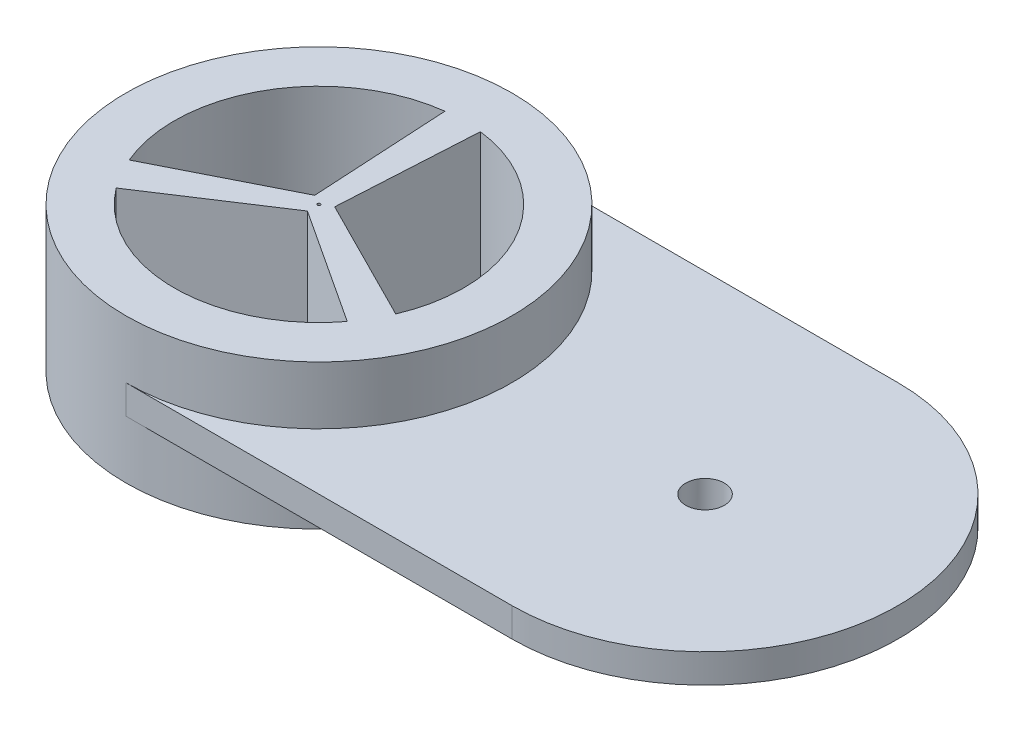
ISO-10303-21;
HEADER;
FILE_DESCRIPTION(('STEP AP214'),'2;1');
FILE_NAME('part.step','',(''),(''),'','','');
FILE_SCHEMA(('AUTOMOTIVE_DESIGN { 1 0 10303 214 1 1 1 1 }'));
ENDSEC;
DATA;
#1=APPLICATION_CONTEXT('core data for automotive mechanical design processes');
#2=APPLICATION_PROTOCOL_DEFINITION('international standard','automotive_design',2000,#1);
#3=PRODUCT_CONTEXT('',#1,'mechanical');
#4=PRODUCT('Part','Part','',(#3));
#5=PRODUCT_RELATED_PRODUCT_CATEGORY('part','',(#4));
#6=PRODUCT_DEFINITION_FORMATION('','',#4);
#7=PRODUCT_DEFINITION_CONTEXT('part definition',#1,'design');
#8=PRODUCT_DEFINITION('design','',#6,#7);
#9=PRODUCT_DEFINITION_SHAPE('','',#8);
#10=(LENGTH_UNIT() NAMED_UNIT(*) SI_UNIT(.MILLI.,.METRE.));
#11=(NAMED_UNIT(*) PLANE_ANGLE_UNIT() SI_UNIT($,.RADIAN.));
#12=(NAMED_UNIT(*) SI_UNIT($,.STERADIAN.) SOLID_ANGLE_UNIT());
#13=UNCERTAINTY_MEASURE_WITH_UNIT(LENGTH_MEASURE(1.E-05),#10,'distance_accuracy_value','');
#14=(GEOMETRIC_REPRESENTATION_CONTEXT(3) GLOBAL_UNCERTAINTY_ASSIGNED_CONTEXT((#13)) GLOBAL_UNIT_ASSIGNED_CONTEXT((#10,
#11,#12)) REPRESENTATION_CONTEXT('',''));
#15=CARTESIAN_POINT('',(0.,0.,0.));
#16=DIRECTION('',(0.,0.,1.));
#17=DIRECTION('',(1.,0.,0.));
#18=AXIS2_PLACEMENT_3D('',#15,#16,#17);
#19=CARTESIAN_POINT('',(0.,15.,0.));
#20=DIRECTION('',(0.,-1.,0.));
#21=DIRECTION('',(0.,0.,-1.));
#22=AXIS2_PLACEMENT_3D('',#19,#20,#21);
#23=CYLINDRICAL_SURFACE('',#22,20.);
#24=CARTESIAN_POINT('',(0.,0.,0.));
#25=DIRECTION('',(0.,1.,0.));
#26=DIRECTION('',(0.,0.,1.));
#27=AXIS2_PLACEMENT_3D('',#24,#25,#26);
#28=CIRCLE('',#27,20.);
#29=CARTESIAN_POINT('',(0.,0.,20.));
#30=VERTEX_POINT('',#29);
#31=EDGE_CURVE('E166',#30,#30,#28,.T.);
#32=ORIENTED_EDGE('',*,*,#31,.T.);
#33=EDGE_LOOP('',(#32));
#34=FACE_BOUND('',#33,.T.);
#35=CARTESIAN_POINT('',(0.,15.,0.));
#36=DIRECTION('',(0.,1.,0.));
#37=DIRECTION('',(0.,0.,1.));
#38=AXIS2_PLACEMENT_3D('',#35,#36,#37);
#39=CIRCLE('',#38,20.);
#40=CARTESIAN_POINT('',(0.,15.,20.));
#41=VERTEX_POINT('',#40);
#42=EDGE_CURVE('E156',#41,#41,#39,.T.);
#43=ORIENTED_EDGE('',*,*,#42,.F.);
#44=EDGE_LOOP('',(#43));
#45=FACE_BOUND('',#44,.T.);
#46=DIRECTION('',(0.,-1.,0.));
#47=VECTOR('',#46,1.);
#48=CARTESIAN_POINT('',(0.,15.,20.));
#49=LINE('',#48,#47);
#50=CARTESIAN_POINT('',(0.,9.00000000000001,20.));
#51=VERTEX_POINT('',#50);
#52=CARTESIAN_POINT('',(0.,6.00000000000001,20.));
#53=VERTEX_POINT('',#52);
#54=EDGE_CURVE('E321',#51,#53,#49,.T.);
#55=ORIENTED_EDGE('',*,*,#54,.F.);
#56=CARTESIAN_POINT('',(0.,9.,0.));
#57=DIRECTION('',(0.,-1.,0.));
#58=DIRECTION('',(0.,0.,-1.));
#59=AXIS2_PLACEMENT_3D('',#56,#57,#58);
#60=CIRCLE('',#59,20.);
#61=CARTESIAN_POINT('',(0.,9.,-20.));
#62=VERTEX_POINT('',#61);
#63=EDGE_CURVE('E316',#62,#51,#60,.T.);
#64=ORIENTED_EDGE('',*,*,#63,.F.);
#65=DIRECTION('',(0.,-1.,0.));
#66=VECTOR('',#65,1.);
#67=CARTESIAN_POINT('',(0.,15.,-20.));
#68=LINE('',#67,#66);
#69=CARTESIAN_POINT('',(0.,6.,-20.));
#70=VERTEX_POINT('',#69);
#71=EDGE_CURVE('E310',#62,#70,#68,.T.);
#72=ORIENTED_EDGE('',*,*,#71,.T.);
#73=CARTESIAN_POINT('',(0.,6.,0.));
#74=DIRECTION('',(0.,1.,0.));
#75=DIRECTION('',(0.,0.,1.));
#76=AXIS2_PLACEMENT_3D('',#73,#74,#75);
#77=CIRCLE('',#76,20.);
#78=EDGE_CURVE('E63',#53,#70,#77,.T.);
#79=ORIENTED_EDGE('',*,*,#78,.F.);
#80=EDGE_LOOP('',(#55,#64,#72,#79));
#81=FACE_BOUND('',#80,.T.);
#82=ADVANCED_FACE('F45',(#34,#45,#81),#23,.T.);
#83=CARTESIAN_POINT('',(0.996804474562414,15.,0.0564385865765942));
#84=DIRECTION('',(0.998400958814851,0.,0.0565289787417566));
#85=DIRECTION('',(0.0565289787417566,0.,-0.998400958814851));
#86=AXIS2_PLACEMENT_3D('',#83,#84,#85);
#87=PLANE('',#86);
#88=DIRECTION('',(-0.0565289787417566,0.,0.998400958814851));
#89=VECTOR('',#88,1.);
#90=CARTESIAN_POINT('',(0.996804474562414,0.,0.0564385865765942));
#91=LINE('',#90,#89);
#92=CARTESIAN_POINT('',(1.84285879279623,0.,-14.8863652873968));
#93=VERTEX_POINT('',#92);
#94=CARTESIAN_POINT('',(1.03377199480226,0.,-0.59647268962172));
#95=VERTEX_POINT('',#94);
#96=EDGE_CURVE('E139',#93,#95,#91,.T.);
#97=ORIENTED_EDGE('',*,*,#96,.F.);
#98=DIRECTION('',(0.,-1.,0.));
#99=VECTOR('',#98,1.);
#100=CARTESIAN_POINT('',(1.84285879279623,15.,-14.8863652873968));
#101=LINE('',#100,#99);
#102=CARTESIAN_POINT('',(1.84285879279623,15.,-14.8863652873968));
#103=VERTEX_POINT('',#102);
#104=EDGE_CURVE('E11',#103,#93,#101,.T.);
#105=ORIENTED_EDGE('',*,*,#104,.F.);
#106=DIRECTION('',(-0.0565289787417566,0.,0.998400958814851));
#107=VECTOR('',#106,1.);
#108=CARTESIAN_POINT('',(0.996804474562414,15.,0.0564385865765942));
#109=LINE('',#108,#107);
#110=CARTESIAN_POINT('',(1.03377199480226,15.,-0.59647268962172));
#111=VERTEX_POINT('',#110);
#112=EDGE_CURVE('E137',#103,#111,#109,.T.);
#113=ORIENTED_EDGE('',*,*,#112,.T.);
#114=DIRECTION('',(0.,-1.,0.));
#115=VECTOR('',#114,1.);
#116=CARTESIAN_POINT('',(1.03377199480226,15.,-0.59647268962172));
#117=LINE('',#116,#115);
#118=EDGE_CURVE('E108',#111,#95,#117,.T.);
#119=ORIENTED_EDGE('',*,*,#118,.T.);
#120=EDGE_LOOP('',(#97,#105,#113,#119));
#121=FACE_BOUND('',#120,.T.);
#122=ADVANCED_FACE('F136',(#121),#87,.T.);
#123=CARTESIAN_POINT('',(0.,15.,0.));
#124=DIRECTION('',(0.,-1.,0.));
#125=DIRECTION('',(0.,0.,-1.));
#126=AXIS2_PLACEMENT_3D('',#123,#124,#125);
#127=CYLINDRICAL_SURFACE('',#126,15.);
#128=CARTESIAN_POINT('',(0.,0.,0.));
#129=DIRECTION('',(0.,1.,0.));
#130=DIRECTION('',(0.,0.,1.));
#131=AXIS2_PLACEMENT_3D('',#128,#129,#130);
#132=CIRCLE('',#131,15.);
#133=CARTESIAN_POINT('',(13.8099212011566,0.,5.85543136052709));
#134=VERTEX_POINT('',#133);
#135=EDGE_CURVE('E177',#134,#93,#132,.T.);
#136=ORIENTED_EDGE('',*,*,#135,.F.);
#137=DIRECTION('',(0.,-1.,0.));
#138=VECTOR('',#137,1.);
#139=CARTESIAN_POINT('',(13.8099212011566,15.,5.85543136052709));
#140=LINE('',#139,#138);
#141=CARTESIAN_POINT('',(13.8099212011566,15.,5.85543136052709));
#142=VERTEX_POINT('',#141);
#143=EDGE_CURVE('E55',#142,#134,#140,.T.);
#144=ORIENTED_EDGE('',*,*,#143,.F.);
#145=CARTESIAN_POINT('',(0.,15.,0.));
#146=DIRECTION('',(0.,1.,0.));
#147=DIRECTION('',(0.,0.,1.));
#148=AXIS2_PLACEMENT_3D('',#145,#146,#147);
#149=CIRCLE('',#148,15.);
#150=EDGE_CURVE('E146',#142,#103,#149,.T.);
#151=ORIENTED_EDGE('',*,*,#150,.T.);
#152=ORIENTED_EDGE('',*,*,#104,.T.);
#153=EDGE_LOOP('',(#136,#144,#151,#152));
#154=FACE_BOUND('',#153,.T.);
#155=ADVANCED_FACE('F150',(#154),#127,.F.);
#156=CARTESIAN_POINT('',(-1.83400829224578,0.,-14.8874582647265));
#157=VERTEX_POINT('',#156);
#158=CARTESIAN_POINT('',(-13.8133999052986,0.,5.84722011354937));
#159=VERTEX_POINT('',#158);
#160=EDGE_CURVE('E218',#157,#159,#132,.T.);
#161=ORIENTED_EDGE('',*,*,#160,.F.);
#162=DIRECTION('',(0.,-1.,0.));
#163=VECTOR('',#162,1.);
#164=CARTESIAN_POINT('',(-1.83400829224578,15.,-14.8874582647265));
#165=LINE('',#164,#163);
#166=CARTESIAN_POINT('',(-1.83400829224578,15.,-14.8874582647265));
#167=VERTEX_POINT('',#166);
#168=EDGE_CURVE('E183',#167,#157,#165,.T.);
#169=ORIENTED_EDGE('',*,*,#168,.F.);
#170=CARTESIAN_POINT('',(-13.8133999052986,15.,5.84722011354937));
#171=VERTEX_POINT('',#170);
#172=EDGE_CURVE('E153',#167,#171,#149,.T.);
#173=ORIENTED_EDGE('',*,*,#172,.T.);
#174=DIRECTION('',(0.,-1.,0.));
#175=VECTOR('',#174,1.);
#176=CARTESIAN_POINT('',(-13.8133999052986,15.,5.84722011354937));
#177=LINE('',#176,#175);
#178=EDGE_CURVE('E186',#171,#159,#177,.T.);
#179=ORIENTED_EDGE('',*,*,#178,.T.);
#180=EDGE_LOOP('',(#161,#169,#173,#179));
#181=FACE_BOUND('',#180,.T.);
#182=ADVANCED_FACE('F438',(#181),#127,.F.);
#183=CARTESIAN_POINT('',(-0.996871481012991,15.,0.055845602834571));
#184=DIRECTION('',(0.998434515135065,0.,-0.0559331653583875));
#185=DIRECTION('',(-0.0559331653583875,0.,-0.998434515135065));
#186=AXIS2_PLACEMENT_3D('',#183,#184,#185);
#187=PLANE('',#186);
#188=DIRECTION('',(0.0559331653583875,0.,0.998434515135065));
#189=VECTOR('',#188,1.);
#190=CARTESIAN_POINT('',(-0.996871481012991,0.,0.055845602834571));
#191=LINE('',#190,#189);
#192=CARTESIAN_POINT('',(-1.03344649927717,0.,-0.59703646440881));
#193=VERTEX_POINT('',#192);
#194=EDGE_CURVE('E226',#157,#193,#191,.T.);
#195=ORIENTED_EDGE('',*,*,#194,.T.);
#196=DIRECTION('',(0.,-1.,0.));
#197=VECTOR('',#196,1.);
#198=CARTESIAN_POINT('',(-1.03344649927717,15.,-0.59703646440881));
#199=LINE('',#198,#197);
#200=CARTESIAN_POINT('',(-1.03344649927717,15.,-0.59703646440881));
#201=VERTEX_POINT('',#200);
#202=EDGE_CURVE('E189',#201,#193,#199,.T.);
#203=ORIENTED_EDGE('',*,*,#202,.F.);
#204=DIRECTION('',(0.0559331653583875,0.,0.998434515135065));
#205=VECTOR('',#204,1.);
#206=CARTESIAN_POINT('',(-0.996871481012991,15.,0.055845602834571));
#207=LINE('',#206,#205);
#208=EDGE_CURVE('E162',#167,#201,#207,.T.);
#209=ORIENTED_EDGE('',*,*,#208,.F.);
#210=ORIENTED_EDGE('',*,*,#168,.T.);
#211=EDGE_LOOP('',(#195,#203,#209,#210));
#212=FACE_BOUND('',#211,.T.);
#213=ADVANCED_FACE('F437',(#212),#187,.F.);
#214=CARTESIAN_POINT('',(-11.9759129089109,0.,9.03202690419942));
#215=VERTEX_POINT('',#214);
#216=CARTESIAN_POINT('',(11.9705411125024,0.,9.03914517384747));
#217=VERTEX_POINT('',#216);
#218=EDGE_CURVE('E210',#215,#217,#132,.T.);
#219=ORIENTED_EDGE('',*,*,#218,.F.);
#220=DIRECTION('',(0.,-1.,0.));
#221=VECTOR('',#220,1.);
#222=CARTESIAN_POINT('',(-11.9759129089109,15.,9.03202690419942));
#223=LINE('',#222,#221);
#224=CARTESIAN_POINT('',(-11.9759129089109,15.,9.03202690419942));
#225=VERTEX_POINT('',#224);
#226=EDGE_CURVE('E116',#225,#215,#223,.T.);
#227=ORIENTED_EDGE('',*,*,#226,.F.);
#228=CARTESIAN_POINT('',(11.9705411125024,15.,9.03914517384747));
#229=VERTEX_POINT('',#228);
#230=EDGE_CURVE('E154',#225,#229,#149,.T.);
#231=ORIENTED_EDGE('',*,*,#230,.T.);
#232=DIRECTION('',(0.,-1.,0.));
#233=VECTOR('',#232,1.);
#234=CARTESIAN_POINT('',(11.9705411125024,15.,9.03914517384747));
#235=LINE('',#234,#233);
#236=EDGE_CURVE('E194',#229,#217,#235,.T.);
#237=ORIENTED_EDGE('',*,*,#236,.T.);
#238=EDGE_LOOP('',(#219,#227,#231,#237));
#239=FACE_BOUND('',#238,.T.);
#240=ADVANCED_FACE('F215',(#239),#127,.F.);
#241=CARTESIAN_POINT('',(0.546799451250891,15.,0.835393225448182));
#242=DIRECTION('',(-0.547656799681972,0.,-0.836703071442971));
#243=DIRECTION('',(-0.836703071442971,0.,0.547656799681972));
#244=AXIS2_PLACEMENT_3D('',#241,#242,#243);
#245=PLANE('',#244);
#246=DIRECTION('',(0.836703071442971,0.,-0.547656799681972));
#247=VECTOR('',#246,1.);
#248=CARTESIAN_POINT('',(0.546799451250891,0.,0.835393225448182));
#249=LINE('',#248,#247);
#250=CARTESIAN_POINT('',(-0.000325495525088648,0.,1.19350915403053));
#251=VERTEX_POINT('',#250);
#252=EDGE_CURVE('E204',#215,#251,#249,.T.);
#253=ORIENTED_EDGE('',*,*,#252,.T.);
#254=DIRECTION('',(0.,-1.,0.));
#255=VECTOR('',#254,1.);
#256=CARTESIAN_POINT('',(-0.000325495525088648,15.,1.19350915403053));
#257=LINE('',#256,#255);
#258=CARTESIAN_POINT('',(-0.000325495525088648,15.,1.19350915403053));
#259=VERTEX_POINT('',#258);
#260=EDGE_CURVE('E197',#259,#251,#257,.T.);
#261=ORIENTED_EDGE('',*,*,#260,.F.);
#262=DIRECTION('',(0.836703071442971,0.,-0.547656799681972));
#263=VECTOR('',#262,1.);
#264=CARTESIAN_POINT('',(0.546799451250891,15.,0.835393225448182));
#265=LINE('',#264,#263);
#266=EDGE_CURVE('E165',#225,#259,#265,.T.);
#267=ORIENTED_EDGE('',*,*,#266,.F.);
#268=ORIENTED_EDGE('',*,*,#226,.T.);
#269=EDGE_LOOP('',(#253,#261,#267,#268));
#270=FACE_BOUND('',#269,.T.);
#271=ADVANCED_FACE('F47',(#270),#245,.F.);
#272=CARTESIAN_POINT('',(0.450072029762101,15.,-0.891238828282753));
#273=DIRECTION('',(-0.450777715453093,0.,0.892636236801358));
#274=DIRECTION('',(0.892636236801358,0.,0.450777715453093));
#275=AXIS2_PLACEMENT_3D('',#272,#273,#274);
#276=PLANE('',#275);
#277=DIRECTION('',(-0.892636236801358,0.,-0.450777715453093));
#278=VECTOR('',#277,1.);
#279=CARTESIAN_POINT('',(0.450072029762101,0.,-0.891238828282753));
#280=LINE('',#279,#278);
#281=EDGE_CURVE('E172',#134,#95,#280,.T.);
#282=ORIENTED_EDGE('',*,*,#281,.T.);
#283=ORIENTED_EDGE('',*,*,#118,.F.);
#284=DIRECTION('',(-0.892636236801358,0.,-0.450777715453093));
#285=VECTOR('',#284,1.);
#286=CARTESIAN_POINT('',(0.450072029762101,15.,-0.891238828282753));
#287=LINE('',#286,#285);
#288=EDGE_CURVE('E72',#142,#111,#287,.T.);
#289=ORIENTED_EDGE('',*,*,#288,.F.);
#290=ORIENTED_EDGE('',*,*,#143,.T.);
#291=EDGE_LOOP('',(#282,#283,#289,#290));
#292=FACE_BOUND('',#291,.T.);
#293=ADVANCED_FACE('F248',(#292),#276,.F.);
#294=CARTESIAN_POINT('',(0.,15.,0.));
#295=DIRECTION('',(0.,-1.,0.));
#296=DIRECTION('',(0.,0.,-1.));
#297=AXIS2_PLACEMENT_3D('',#294,#295,#296);
#298=CYLINDRICAL_SURFACE('',#297,0.15);
#299=CARTESIAN_POINT('',(0.,15.,0.));
#300=DIRECTION('',(0.,1.,0.));
#301=DIRECTION('',(0.,0.,1.));
#302=AXIS2_PLACEMENT_3D('',#299,#300,#301);
#303=CIRCLE('',#302,0.15);
#304=CARTESIAN_POINT('',(0.,15.,0.15));
#305=VERTEX_POINT('',#304);
#306=EDGE_CURVE('E148',#305,#305,#303,.T.);
#307=ORIENTED_EDGE('',*,*,#306,.T.);
#308=EDGE_LOOP('',(#307));
#309=FACE_BOUND('',#308,.T.);
#310=CARTESIAN_POINT('',(0.,0.,0.));
#311=DIRECTION('',(0.,1.,0.));
#312=DIRECTION('',(0.,0.,1.));
#313=AXIS2_PLACEMENT_3D('',#310,#311,#312);
#314=CIRCLE('',#313,0.15);
#315=CARTESIAN_POINT('',(0.,0.,0.15));
#316=VERTEX_POINT('',#315);
#317=EDGE_CURVE('E240',#316,#316,#314,.T.);
#318=ORIENTED_EDGE('',*,*,#317,.F.);
#319=EDGE_LOOP('',(#318));
#320=FACE_BOUND('',#319,.T.);
#321=ADVANCED_FACE('F250',(#309,#320),#298,.F.);
#322=CARTESIAN_POINT('',(-0.449524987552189,15.,-0.891477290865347));
#323=DIRECTION('',(-0.450244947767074,0.,-0.89290508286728));
#324=DIRECTION('',(-0.89290508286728,0.,0.450244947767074));
#325=AXIS2_PLACEMENT_3D('',#322,#323,#324);
#326=PLANE('',#325);
#327=DIRECTION('',(0.89290508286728,0.,-0.450244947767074));
#328=VECTOR('',#327,1.);
#329=CARTESIAN_POINT('',(-0.449524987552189,0.,-0.891477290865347));
#330=LINE('',#329,#328);
#331=EDGE_CURVE('E234',#159,#193,#330,.T.);
#332=ORIENTED_EDGE('',*,*,#331,.F.);
#333=ORIENTED_EDGE('',*,*,#178,.F.);
#334=DIRECTION('',(0.89290508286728,0.,-0.450244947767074));
#335=VECTOR('',#334,1.);
#336=CARTESIAN_POINT('',(-0.449524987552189,15.,-0.891477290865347));
#337=LINE('',#336,#335);
#338=EDGE_CURVE('E573',#171,#201,#337,.T.);
#339=ORIENTED_EDGE('',*,*,#338,.T.);
#340=ORIENTED_EDGE('',*,*,#202,.T.);
#341=EDGE_LOOP('',(#332,#333,#339,#340));
#342=FACE_BOUND('',#341,.T.);
#343=ADVANCED_FACE('F256',(#342),#326,.T.);
#344=CARTESIAN_POINT('',(-0.547279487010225,15.,0.835038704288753));
#345=DIRECTION('',(-0.548156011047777,0.,0.836376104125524));
#346=DIRECTION('',(0.836376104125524,0.,0.548156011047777));
#347=AXIS2_PLACEMENT_3D('',#344,#345,#346);
#348=PLANE('',#347);
#349=DIRECTION('',(-0.836376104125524,0.,-0.548156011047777));
#350=VECTOR('',#349,1.);
#351=CARTESIAN_POINT('',(-0.547279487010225,0.,0.835038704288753));
#352=LINE('',#351,#350);
#353=EDGE_CURVE('E212',#217,#251,#352,.T.);
#354=ORIENTED_EDGE('',*,*,#353,.F.);
#355=ORIENTED_EDGE('',*,*,#236,.F.);
#356=DIRECTION('',(-0.836376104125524,0.,-0.548156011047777));
#357=VECTOR('',#356,1.);
#358=CARTESIAN_POINT('',(-0.547279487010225,15.,0.835038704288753));
#359=LINE('',#358,#357);
#360=EDGE_CURVE('E163',#229,#259,#359,.T.);
#361=ORIENTED_EDGE('',*,*,#360,.T.);
#362=ORIENTED_EDGE('',*,*,#260,.T.);
#363=EDGE_LOOP('',(#354,#355,#361,#362));
#364=FACE_BOUND('',#363,.T.);
#365=ADVANCED_FACE('F274',(#364),#348,.T.);
#366=CARTESIAN_POINT('',(0.,15.,0.));
#367=DIRECTION('',(0.,1.,0.));
#368=DIRECTION('',(0.,0.,1.));
#369=AXIS2_PLACEMENT_3D('',#366,#367,#368);
#370=PLANE('',#369);
#371=ORIENTED_EDGE('',*,*,#230,.F.);
#372=ORIENTED_EDGE('',*,*,#266,.T.);
#373=ORIENTED_EDGE('',*,*,#360,.F.);
#374=EDGE_LOOP('',(#371,#372,#373));
#375=FACE_BOUND('',#374,.T.);
#376=ORIENTED_EDGE('',*,*,#172,.F.);
#377=ORIENTED_EDGE('',*,*,#208,.T.);
#378=ORIENTED_EDGE('',*,*,#338,.F.);
#379=EDGE_LOOP('',(#376,#377,#378));
#380=FACE_BOUND('',#379,.T.);
#381=ORIENTED_EDGE('',*,*,#306,.F.);
#382=EDGE_LOOP('',(#381));
#383=FACE_BOUND('',#382,.T.);
#384=ORIENTED_EDGE('',*,*,#112,.F.);
#385=ORIENTED_EDGE('',*,*,#150,.F.);
#386=ORIENTED_EDGE('',*,*,#288,.T.);
#387=EDGE_LOOP('',(#384,#385,#386));
#388=FACE_BOUND('',#387,.T.);
#389=ORIENTED_EDGE('',*,*,#42,.T.);
#390=EDGE_LOOP('',(#389));
#391=FACE_BOUND('',#390,.T.);
#392=ADVANCED_FACE('F144',(#375,#380,#383,#388,#391),#370,.T.);
#393=CARTESIAN_POINT('',(0.,0.,0.));
#394=DIRECTION('',(0.,1.,0.));
#395=DIRECTION('',(0.,0.,1.));
#396=AXIS2_PLACEMENT_3D('',#393,#394,#395);
#397=PLANE('',#396);
#398=ORIENTED_EDGE('',*,*,#218,.T.);
#399=ORIENTED_EDGE('',*,*,#353,.T.);
#400=ORIENTED_EDGE('',*,*,#252,.F.);
#401=EDGE_LOOP('',(#398,#399,#400));
#402=FACE_BOUND('',#401,.T.);
#403=ORIENTED_EDGE('',*,*,#160,.T.);
#404=ORIENTED_EDGE('',*,*,#331,.T.);
#405=ORIENTED_EDGE('',*,*,#194,.F.);
#406=EDGE_LOOP('',(#403,#404,#405));
#407=FACE_BOUND('',#406,.T.);
#408=ORIENTED_EDGE('',*,*,#317,.T.);
#409=EDGE_LOOP('',(#408));
#410=FACE_BOUND('',#409,.T.);
#411=ORIENTED_EDGE('',*,*,#96,.T.);
#412=ORIENTED_EDGE('',*,*,#281,.F.);
#413=ORIENTED_EDGE('',*,*,#135,.T.);
#414=EDGE_LOOP('',(#411,#412,#413));
#415=FACE_BOUND('',#414,.T.);
#416=ORIENTED_EDGE('',*,*,#31,.F.);
#417=EDGE_LOOP('',(#416));
#418=FACE_BOUND('',#417,.T.);
#419=ADVANCED_FACE('F208',(#402,#407,#410,#415,#418),#397,.F.);
#420=CARTESIAN_POINT('',(40.,15.,0.));
#421=DIRECTION('',(0.,-1.,0.));
#422=DIRECTION('',(0.,0.,-1.));
#423=AXIS2_PLACEMENT_3D('',#420,#421,#422);
#424=CYLINDRICAL_SURFACE('',#423,20.);
#425=DIRECTION('',(0.,-1.,0.));
#426=VECTOR('',#425,1.);
#427=CARTESIAN_POINT('',(40.,15.,20.));
#428=LINE('',#427,#426);
#429=CARTESIAN_POINT('',(40.,9.00000000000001,20.));
#430=VERTEX_POINT('',#429);
#431=CARTESIAN_POINT('',(40.,6.00000000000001,20.));
#432=VERTEX_POINT('',#431);
#433=EDGE_CURVE('E308',#430,#432,#428,.T.);
#434=ORIENTED_EDGE('',*,*,#433,.T.);
#435=CARTESIAN_POINT('',(40.,6.,0.));
#436=DIRECTION('',(0.,1.,0.));
#437=DIRECTION('',(0.,0.,1.));
#438=AXIS2_PLACEMENT_3D('',#435,#436,#437);
#439=CIRCLE('',#438,20.);
#440=CARTESIAN_POINT('',(40.,6.,-20.));
#441=VERTEX_POINT('',#440);
#442=EDGE_CURVE('E220',#432,#441,#439,.T.);
#443=ORIENTED_EDGE('',*,*,#442,.T.);
#444=DIRECTION('',(0.,-1.,0.));
#445=VECTOR('',#444,1.);
#446=CARTESIAN_POINT('',(40.,15.,-20.));
#447=LINE('',#446,#445);
#448=CARTESIAN_POINT('',(40.,9.,-20.));
#449=VERTEX_POINT('',#448);
#450=EDGE_CURVE('E315',#449,#441,#447,.T.);
#451=ORIENTED_EDGE('',*,*,#450,.F.);
#452=CARTESIAN_POINT('',(40.,9.,0.));
#453=DIRECTION('',(0.,-1.,0.));
#454=DIRECTION('',(0.,0.,-1.));
#455=AXIS2_PLACEMENT_3D('',#452,#453,#454);
#456=CIRCLE('',#455,20.);
#457=EDGE_CURVE('E333',#449,#430,#456,.T.);
#458=ORIENTED_EDGE('',*,*,#457,.T.);
#459=EDGE_LOOP('',(#434,#443,#451,#458));
#460=FACE_BOUND('',#459,.T.);
#461=ADVANCED_FACE('F270',(#460),#424,.T.);
#462=CARTESIAN_POINT('',(0.,15.,20.));
#463=DIRECTION('',(0.,0.,1.));
#464=DIRECTION('',(1.,0.,0.));
#465=AXIS2_PLACEMENT_3D('',#462,#463,#464);
#466=PLANE('',#465);
#467=ORIENTED_EDGE('',*,*,#433,.F.);
#468=DIRECTION('',(1.,0.,0.));
#469=VECTOR('',#468,1.);
#470=CARTESIAN_POINT('',(0.,9.00000000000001,20.));
#471=LINE('',#470,#469);
#472=EDGE_CURVE('E326',#51,#430,#471,.T.);
#473=ORIENTED_EDGE('',*,*,#472,.F.);
#474=ORIENTED_EDGE('',*,*,#54,.T.);
#475=DIRECTION('',(1.,0.,0.));
#476=VECTOR('',#475,1.);
#477=CARTESIAN_POINT('',(0.,6.00000000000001,20.));
#478=LINE('',#477,#476);
#479=EDGE_CURVE('E325',#53,#432,#478,.T.);
#480=ORIENTED_EDGE('',*,*,#479,.T.);
#481=EDGE_LOOP('',(#467,#473,#474,#480));
#482=FACE_BOUND('',#481,.T.);
#483=ADVANCED_FACE('F278',(#482),#466,.T.);
#484=CARTESIAN_POINT('',(0.,9.00000000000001,20.));
#485=DIRECTION('',(0.,1.,0.));
#486=DIRECTION('',(0.,0.,1.));
#487=AXIS2_PLACEMENT_3D('',#484,#485,#486);
#488=PLANE('',#487);
#489=CARTESIAN_POINT('',(40.,9.,0.));
#490=DIRECTION('',(0.,1.,0.));
#491=DIRECTION('',(0.,0.,1.));
#492=AXIS2_PLACEMENT_3D('',#489,#490,#491);
#493=CIRCLE('',#492,2.);
#494=CARTESIAN_POINT('',(40.,9.,1.99999999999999));
#495=VERTEX_POINT('',#494);
#496=EDGE_CURVE('E304',#495,#495,#493,.T.);
#497=ORIENTED_EDGE('',*,*,#496,.F.);
#498=EDGE_LOOP('',(#497));
#499=FACE_BOUND('',#498,.T.);
#500=ORIENTED_EDGE('',*,*,#457,.F.);
#501=DIRECTION('',(1.,0.,0.));
#502=VECTOR('',#501,1.);
#503=CARTESIAN_POINT('',(0.,9.,-20.));
#504=LINE('',#503,#502);
#505=EDGE_CURVE('E320',#62,#449,#504,.T.);
#506=ORIENTED_EDGE('',*,*,#505,.F.);
#507=ORIENTED_EDGE('',*,*,#63,.T.);
#508=ORIENTED_EDGE('',*,*,#472,.T.);
#509=EDGE_LOOP('',(#500,#506,#507,#508));
#510=FACE_BOUND('',#509,.T.);
#511=ADVANCED_FACE('F284',(#499,#510),#488,.T.);
#512=CARTESIAN_POINT('',(0.,6.,-20.));
#513=DIRECTION('',(0.,-1.,0.));
#514=DIRECTION('',(0.,0.,-1.));
#515=AXIS2_PLACEMENT_3D('',#512,#513,#514);
#516=PLANE('',#515);
#517=CARTESIAN_POINT('',(40.,6.,0.));
#518=DIRECTION('',(0.,-1.,0.));
#519=DIRECTION('',(0.,0.,-1.));
#520=AXIS2_PLACEMENT_3D('',#517,#518,#519);
#521=CIRCLE('',#520,2.);
#522=CARTESIAN_POINT('',(40.,6.,-2.00000000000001));
#523=VERTEX_POINT('',#522);
#524=EDGE_CURVE('E49',#523,#523,#521,.T.);
#525=ORIENTED_EDGE('',*,*,#524,.F.);
#526=EDGE_LOOP('',(#525));
#527=FACE_BOUND('',#526,.T.);
#528=ORIENTED_EDGE('',*,*,#442,.F.);
#529=ORIENTED_EDGE('',*,*,#479,.F.);
#530=ORIENTED_EDGE('',*,*,#78,.T.);
#531=DIRECTION('',(1.,0.,0.));
#532=VECTOR('',#531,1.);
#533=CARTESIAN_POINT('',(0.,6.,-20.));
#534=LINE('',#533,#532);
#535=EDGE_CURVE('E314',#70,#441,#534,.T.);
#536=ORIENTED_EDGE('',*,*,#535,.T.);
#537=EDGE_LOOP('',(#528,#529,#530,#536));
#538=FACE_BOUND('',#537,.T.);
#539=ADVANCED_FACE('F281',(#527,#538),#516,.T.);
#540=CARTESIAN_POINT('',(0.,15.,-20.));
#541=DIRECTION('',(0.,0.,1.));
#542=DIRECTION('',(1.,0.,0.));
#543=AXIS2_PLACEMENT_3D('',#540,#541,#542);
#544=PLANE('',#543);
#545=ORIENTED_EDGE('',*,*,#450,.T.);
#546=ORIENTED_EDGE('',*,*,#535,.F.);
#547=ORIENTED_EDGE('',*,*,#71,.F.);
#548=ORIENTED_EDGE('',*,*,#505,.T.);
#549=EDGE_LOOP('',(#545,#546,#547,#548));
#550=FACE_BOUND('',#549,.T.);
#551=ADVANCED_FACE('F271',(#550),#544,.F.);
#552=CARTESIAN_POINT('',(40.,4.,0.));
#553=DIRECTION('',(0.,1.,0.));
#554=DIRECTION('',(0.,0.,1.));
#555=AXIS2_PLACEMENT_3D('',#552,#553,#554);
#556=CYLINDRICAL_SURFACE('',#555,2.);
#557=ORIENTED_EDGE('',*,*,#524,.T.);
#558=EDGE_LOOP('',(#557));
#559=FACE_BOUND('',#558,.T.);
#560=ORIENTED_EDGE('',*,*,#496,.T.);
#561=EDGE_LOOP('',(#560));
#562=FACE_BOUND('',#561,.T.);
#563=ADVANCED_FACE('F280',(#559,#562),#556,.F.);
#564=CLOSED_SHELL('',(#82,#122,#155,#182,#213,#240,#271,#293,#321,#343,#365,#392,#419,#461,#483,
#511,#539,#551,#563));
#565=MANIFOLD_SOLID_BREP('B2',#564);
#566=ADVANCED_BREP_SHAPE_REPRESENTATION('',(#18,#565),#14);
#567=SHAPE_DEFINITION_REPRESENTATION(#9,#566);
ENDSEC;
END-ISO-10303-21;
